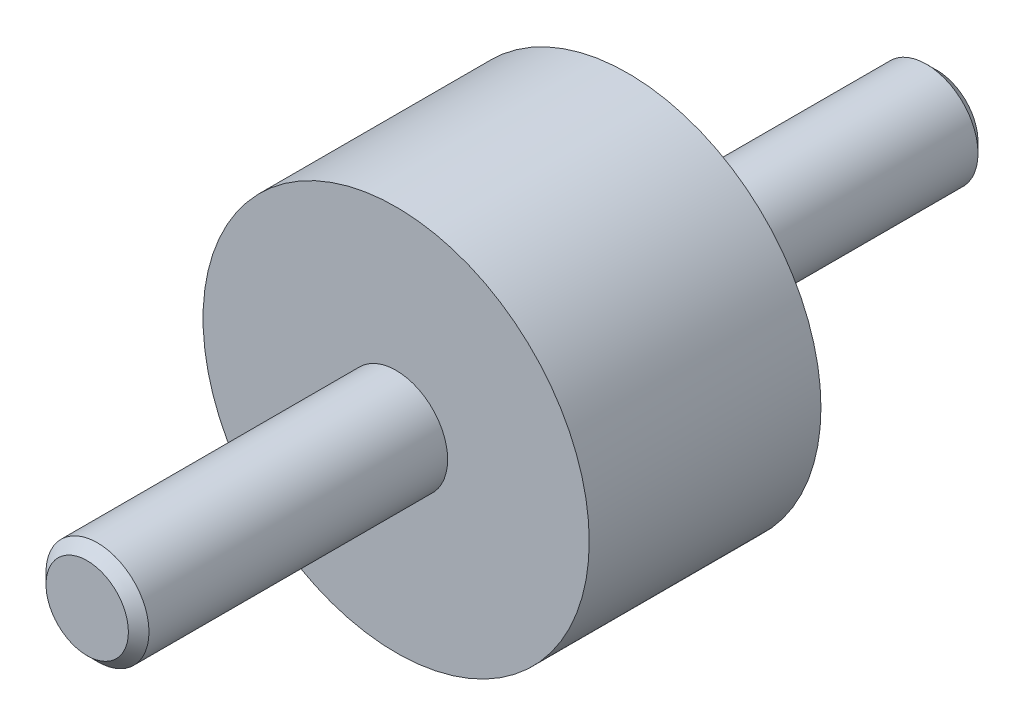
from build123d import *

# Parameters (mm, degrees)
ESQUISSE1_R      = 7.5
EXTRUSION1_DEPTH = 9
ESQUISSE2_R      = 2
EXTRUSION2_DEPTH = 12
EXTRUSION3_START = 12
ESQUISSE3_R      = 2
EXTRUSION3_DEPTH = 12
CHANFREIN1_SIZE  = 0.4


with BuildPart() as part:
    # Esquisse1 → Extrusion1 (new body)
    with BuildSketch(Plane.XY):
        Circle(ESQUISSE1_R)
    extrude(amount=EXTRUSION1_DEPTH)

    # Esquisse2 → Extrusion2 (add)
    with BuildSketch(Plane.XY.offset(9)):
        Circle(ESQUISSE2_R)
    extrude(amount=EXTRUSION2_DEPTH)

    # Esquisse3 → Extrusion3 (add)
    with BuildSketch(Plane(origin=(0, 0, 0), x_dir=(-1, 0, 0), z_dir=(0, 0, -1)).offset(EXTRUSION3_START)):
        with Locations(Location((0, 0, 0), (0, 0, 180))):
            Circle(ESQUISSE3_R)
    extrude(amount=-EXTRUSION3_DEPTH)

    # Chanfrein1
    chanfrein1_edges = [part.edges().sort_by_distance(p)[0] for p in [
        (-2, 0, -12),
        (-2, 0, 21),
    ]]
    chamfer(chanfrein1_edges, length=CHANFREIN1_SIZE)


solid = part.part
